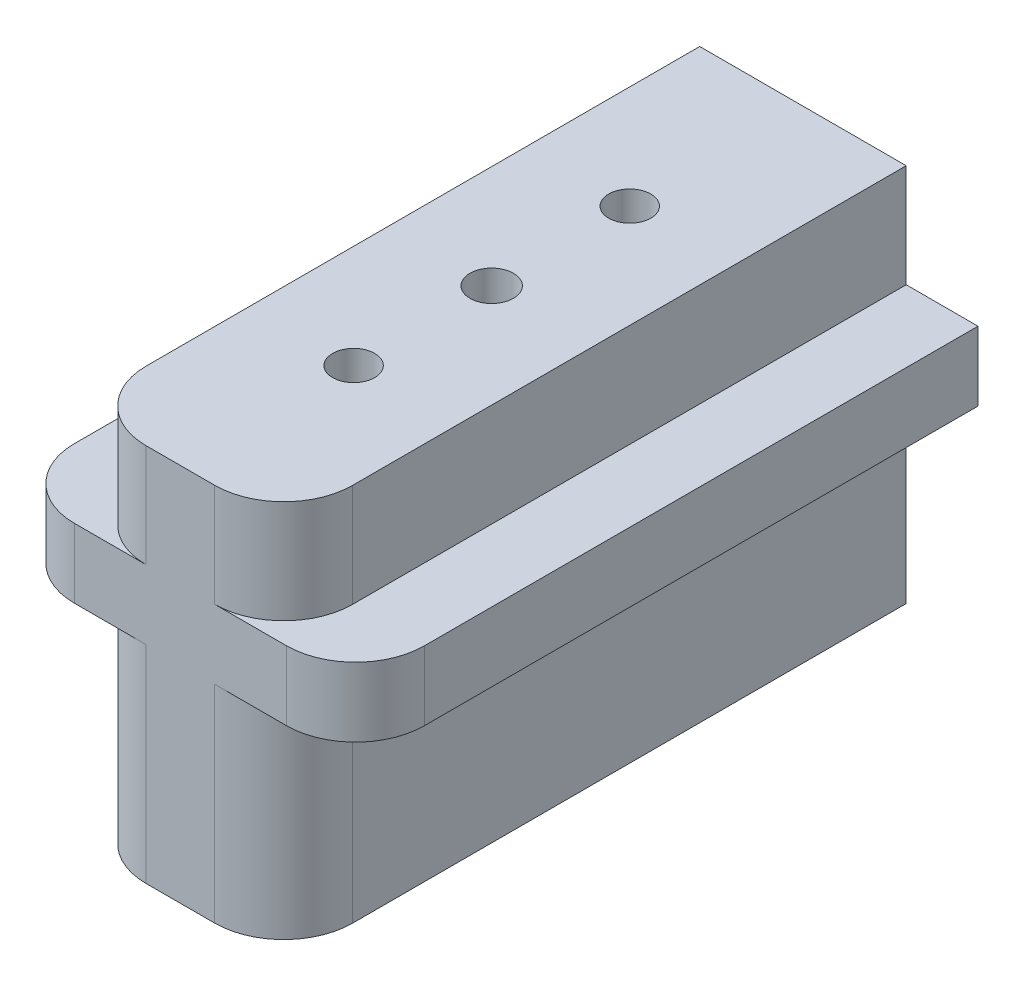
from build123d import *

# Parameters (mm, degrees)
SKETCH1_W                    = 14.2494
SKETCH1_H                    = 42.9514
EXTRUDE1_DEPTH               = 13.081
EXTRUDE2_START               = -11.8872
SKETCH2_W                    = 24.1554
SKETCH2_H                    = 42.9514
EXTRUDE2_DEPTH               = 4.7752
FILLET1_R                    = 4.7625
FILLET2_R                    = 4.7625
M3_5X0_6_TAPPED_HOLE1_D      = 2.9
M3_5X0_6_TAPPED_HOLE1_DEPTH  = 9.65
M3_5X0_6_TAPPED_HOLE1_TIP    = 0.871247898
F_3_0_3_DIAMETER_HOLE1_D     = 3
F_3_0_3_DIAMETER_HOLE1_DEPTH = 6
F_3_0_3_DIAMETER_HOLE1_TIP   = 0.901290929


with BuildPart() as part:
    # Sketch1 → Extrude1 (new, symmetric)
    with BuildSketch(Plane(origin=(0, 0, 0), x_dir=(1, 0, 0), z_dir=(0, 1, 0))):
        Rectangle(SKETCH1_W, SKETCH1_H)
    extrude(amount=EXTRUDE1_DEPTH, both=True)

    # Sketch2 → Extrude2 (add)
    with BuildSketch(Plane(origin=(0, 13.081, 0), x_dir=(-1, 0, 0), z_dir=(0, 1, 0)).offset(EXTRUDE2_START)):
        Rectangle(SKETCH2_W, SKETCH2_H)
    extrude(amount=EXTRUDE2_DEPTH)

    # Fillet1
    fillet1_edges = [part.edges().sort_by_distance(p)[0] for p in [
        (7.1247, -5.9436, 21.4757),
        (-7.1247, -5.9436, 21.4757),
        (7.1247, 9.525, 21.4757),
        (-7.1247, 9.525, 21.4757),
    ]]
    fillet(fillet1_edges, radius=FILLET1_R)

    # Fillet2
    fillet2_edges = [part.edges().sort_by_distance(p)[0] for p in [
        (-12.0777, 3.5814, 21.4757),
        (12.0777, 3.5814, 21.4757),
    ]]
    fillet(fillet2_edges, radius=FILLET2_R)

    # M3.5x0.6 Tapped Hole1
    with Locations(Plane(origin=(0, 13.081, 9.525), x_dir=(0, 0, 1), z_dir=(0, 1, 0))):
        with Locations((0, 0), (-19.05, 0)):
            Hole(M3_5X0_6_TAPPED_HOLE1_D / 2, depth=M3_5X0_6_TAPPED_HOLE1_DEPTH)
            with Locations((0, 0, -(M3_5X0_6_TAPPED_HOLE1_DEPTH + M3_5X0_6_TAPPED_HOLE1_TIP / 2))):  # 118° drill point
                Cone(0, M3_5X0_6_TAPPED_HOLE1_D / 2, M3_5X0_6_TAPPED_HOLE1_TIP, mode=Mode.SUBTRACT)

    # 3.0 _3_ Diameter Hole1
    with Locations(Plane.ZX.offset(13.081)):
        with Locations((0, 0)):
            Hole(F_3_0_3_DIAMETER_HOLE1_D / 2, depth=F_3_0_3_DIAMETER_HOLE1_DEPTH)
            with Locations((0, 0, -(F_3_0_3_DIAMETER_HOLE1_DEPTH + F_3_0_3_DIAMETER_HOLE1_TIP / 2))):  # 118° drill point
                Cone(0, F_3_0_3_DIAMETER_HOLE1_D / 2, F_3_0_3_DIAMETER_HOLE1_TIP, mode=Mode.SUBTRACT)


solid = part.part
